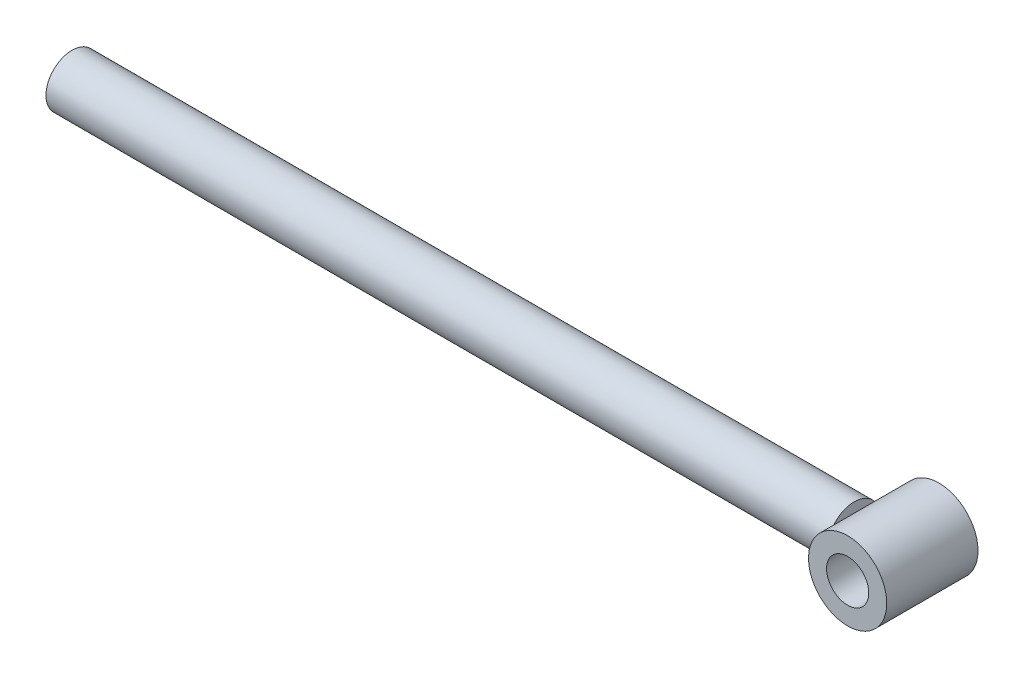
from build123d import *

# Parameters (mm, degrees)
ESQUISSE1_R      = 10
EXTRUSION1_DEPTH = 300
ESQUISSE2_R      = 15
ESQUISSE2_R_2    = 8.1
EXTRUSION2_DEPTH = 17.5


with BuildPart() as part:
    # Esquisse1 → Extrusion1 (new body)
    with BuildSketch(Plane(origin=(0, 0, 0), x_dir=(0, 0, -1), z_dir=(1, 0, 0))):
        Circle(ESQUISSE1_R)
    extrude(amount=EXTRUSION1_DEPTH)


with BuildPart() as body_2:
    # Esquisse2 → Extrusion2 (new, symmetric)
    with BuildSketch(Plane.XY):
        with Locations((315, 0)):
            Circle(ESQUISSE2_R)
        with Locations((315, 0)):
            Circle(ESQUISSE2_R_2, mode=Mode.SUBTRACT)
    extrude(amount=EXTRUSION2_DEPTH, both=True)


solid = Compound([part.part, body_2.part])
